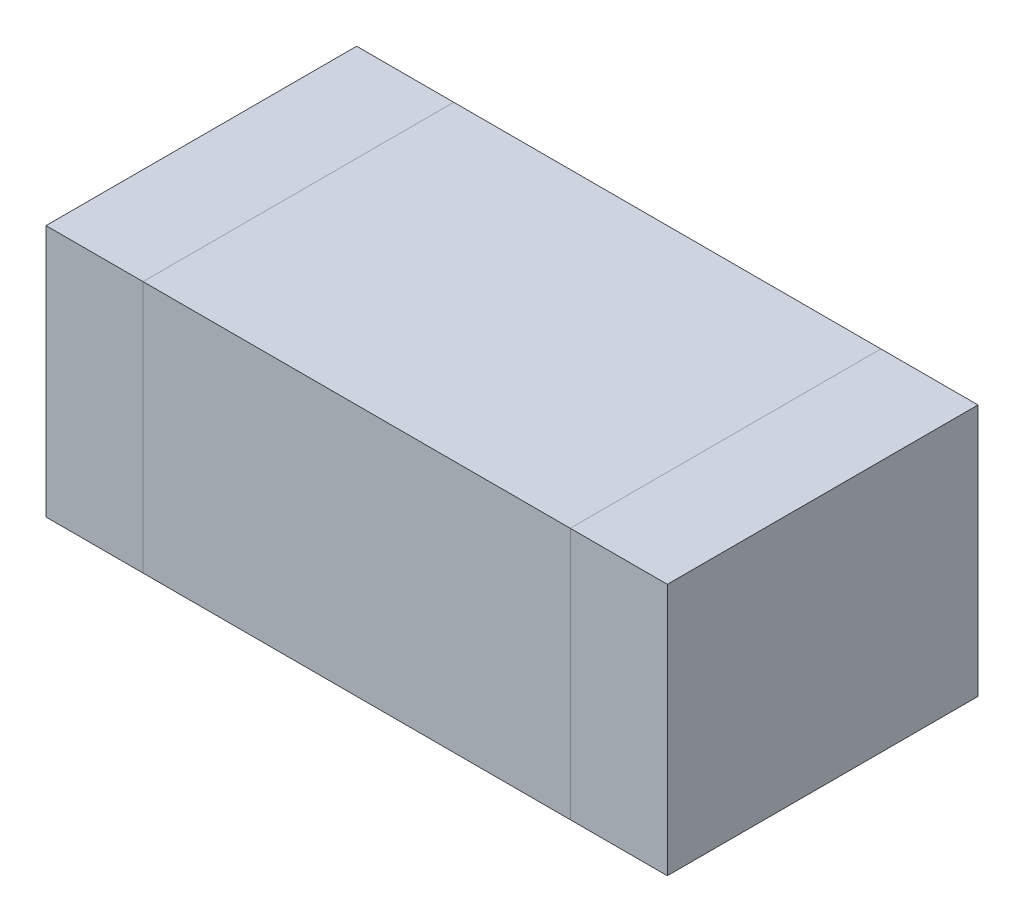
ISO-10303-21;
HEADER;
FILE_DESCRIPTION(('STEP AP214'),'2;1');
FILE_NAME('part.step','',(''),(''),'','','');
FILE_SCHEMA(('AUTOMOTIVE_DESIGN { 1 0 10303 214 1 1 1 1 }'));
ENDSEC;
DATA;
#1=APPLICATION_CONTEXT('core data for automotive mechanical design processes');
#2=APPLICATION_PROTOCOL_DEFINITION('international standard','automotive_design',2000,#1);
#3=PRODUCT_CONTEXT('',#1,'mechanical');
#4=PRODUCT('Part','Part','',(#3));
#5=PRODUCT_RELATED_PRODUCT_CATEGORY('part','',(#4));
#6=PRODUCT_DEFINITION_FORMATION('','',#4);
#7=PRODUCT_DEFINITION_CONTEXT('part definition',#1,'design');
#8=PRODUCT_DEFINITION('design','',#6,#7);
#9=PRODUCT_DEFINITION_SHAPE('','',#8);
#10=(LENGTH_UNIT() NAMED_UNIT(*) SI_UNIT(.MILLI.,.METRE.));
#11=(NAMED_UNIT(*) PLANE_ANGLE_UNIT() SI_UNIT($,.RADIAN.));
#12=(NAMED_UNIT(*) SI_UNIT($,.STERADIAN.) SOLID_ANGLE_UNIT());
#13=UNCERTAINTY_MEASURE_WITH_UNIT(LENGTH_MEASURE(1.E-05),#10,'distance_accuracy_value','');
#14=(GEOMETRIC_REPRESENTATION_CONTEXT(3) GLOBAL_UNCERTAINTY_ASSIGNED_CONTEXT((#13)) GLOBAL_UNIT_ASSIGNED_CONTEXT((#10,
#11,#12)) REPRESENTATION_CONTEXT('',''));
#15=CARTESIAN_POINT('',(0.,0.,0.));
#16=DIRECTION('',(0.,0.,1.));
#17=DIRECTION('',(1.,0.,0.));
#18=AXIS2_PLACEMENT_3D('',#15,#16,#17);
#19=CARTESIAN_POINT('',(2.7,-0.01,-1.6));
#20=DIRECTION('',(-1.,0.,0.));
#21=DIRECTION('',(0.,0.,1.));
#22=AXIS2_PLACEMENT_3D('',#19,#20,#21);
#23=PLANE('',#22);
#24=DIRECTION('',(0.,0.,-1.));
#25=VECTOR('',#24,1.);
#26=CARTESIAN_POINT('',(2.7,0.,0.));
#27=LINE('',#26,#25);
#28=CARTESIAN_POINT('',(2.7,0.,0.));
#29=VERTEX_POINT('',#28);
#30=CARTESIAN_POINT('',(2.7,0.,-1.6));
#31=VERTEX_POINT('',#30);
#32=EDGE_CURVE('E52',#29,#31,#27,.T.);
#33=ORIENTED_EDGE('',*,*,#32,.F.);
#34=DIRECTION('',(0.,1.,0.));
#35=VECTOR('',#34,1.);
#36=CARTESIAN_POINT('',(2.7,-0.01,0.));
#37=LINE('',#36,#35);
#38=CARTESIAN_POINT('',(2.7,1.3,0.));
#39=VERTEX_POINT('',#38);
#40=EDGE_CURVE('E94',#29,#39,#37,.T.);
#41=ORIENTED_EDGE('',*,*,#40,.T.);
#42=DIRECTION('',(0.,0.,-1.));
#43=VECTOR('',#42,1.);
#44=CARTESIAN_POINT('',(2.7,1.3,0.));
#45=LINE('',#44,#43);
#46=CARTESIAN_POINT('',(2.7,1.3,-1.6));
#47=VERTEX_POINT('',#46);
#48=EDGE_CURVE('E101',#39,#47,#45,.T.);
#49=ORIENTED_EDGE('',*,*,#48,.T.);
#50=DIRECTION('',(0.,-1.,0.));
#51=VECTOR('',#50,1.);
#52=CARTESIAN_POINT('',(2.7,1.3,-1.6));
#53=LINE('',#52,#51);
#54=EDGE_CURVE('E102',#47,#31,#53,.T.);
#55=ORIENTED_EDGE('',*,*,#54,.T.);
#56=EDGE_LOOP('',(#33,#41,#49,#55));
#57=FACE_BOUND('',#56,.T.);
#58=ADVANCED_FACE('F48',(#57),#23,.T.);
#59=CARTESIAN_POINT('',(0.,0.,0.));
#60=DIRECTION('',(0.,-1.,0.));
#61=DIRECTION('',(0.,0.,-1.));
#62=AXIS2_PLACEMENT_3D('',#59,#60,#61);
#63=PLANE('',#62);
#64=DIRECTION('',(1.,0.,0.));
#65=VECTOR('',#64,1.);
#66=CARTESIAN_POINT('',(0.,0.,0.));
#67=LINE('',#66,#65);
#68=CARTESIAN_POINT('',(3.2,0.,0.));
#69=VERTEX_POINT('',#68);
#70=EDGE_CURVE('E12',#29,#69,#67,.T.);
#71=ORIENTED_EDGE('',*,*,#70,.F.);
#72=ORIENTED_EDGE('',*,*,#32,.T.);
#73=DIRECTION('',(-1.,0.,0.));
#74=VECTOR('',#73,1.);
#75=CARTESIAN_POINT('',(0.,0.,-1.6));
#76=LINE('',#75,#74);
#77=CARTESIAN_POINT('',(3.2,0.,-1.6));
#78=VERTEX_POINT('',#77);
#79=EDGE_CURVE('E97',#78,#31,#76,.T.);
#80=ORIENTED_EDGE('',*,*,#79,.F.);
#81=DIRECTION('',(0.,0.,-1.));
#82=VECTOR('',#81,1.);
#83=CARTESIAN_POINT('',(3.2,0.,0.));
#84=LINE('',#83,#82);
#85=EDGE_CURVE('E58',#69,#78,#84,.T.);
#86=ORIENTED_EDGE('',*,*,#85,.F.);
#87=EDGE_LOOP('',(#71,#72,#80,#86));
#88=FACE_BOUND('',#87,.T.);
#89=ADVANCED_FACE('F120',(#88),#63,.T.);
#90=CARTESIAN_POINT('',(0.,1.3,0.));
#91=DIRECTION('',(0.,0.,-1.));
#92=DIRECTION('',(-1.,0.,0.));
#93=AXIS2_PLACEMENT_3D('',#90,#91,#92);
#94=PLANE('',#93);
#95=ORIENTED_EDGE('',*,*,#40,.F.);
#96=ORIENTED_EDGE('',*,*,#70,.T.);
#97=DIRECTION('',(0.,-1.,0.));
#98=VECTOR('',#97,1.);
#99=CARTESIAN_POINT('',(3.2,1.3,0.));
#100=LINE('',#99,#98);
#101=CARTESIAN_POINT('',(3.2,1.3,0.));
#102=VERTEX_POINT('',#101);
#103=EDGE_CURVE('E95',#102,#69,#100,.T.);
#104=ORIENTED_EDGE('',*,*,#103,.F.);
#105=DIRECTION('',(1.,0.,0.));
#106=VECTOR('',#105,1.);
#107=CARTESIAN_POINT('',(0.,1.3,0.));
#108=LINE('',#107,#106);
#109=EDGE_CURVE('E91',#39,#102,#108,.T.);
#110=ORIENTED_EDGE('',*,*,#109,.F.);
#111=EDGE_LOOP('',(#95,#96,#104,#110));
#112=FACE_BOUND('',#111,.T.);
#113=ADVANCED_FACE('F93',(#112),#94,.F.);
#114=CARTESIAN_POINT('',(0.,1.3,-1.6));
#115=DIRECTION('',(0.,0.,1.));
#116=DIRECTION('',(1.,0.,0.));
#117=AXIS2_PLACEMENT_3D('',#114,#115,#116);
#118=PLANE('',#117);
#119=ORIENTED_EDGE('',*,*,#54,.F.);
#120=DIRECTION('',(-1.,0.,0.));
#121=VECTOR('',#120,1.);
#122=CARTESIAN_POINT('',(0.,1.3,-1.6));
#123=LINE('',#122,#121);
#124=CARTESIAN_POINT('',(3.2,1.3,-1.6));
#125=VERTEX_POINT('',#124);
#126=EDGE_CURVE('E104',#125,#47,#123,.T.);
#127=ORIENTED_EDGE('',*,*,#126,.F.);
#128=DIRECTION('',(0.,-1.,0.));
#129=VECTOR('',#128,1.);
#130=CARTESIAN_POINT('',(3.2,1.3,-1.6));
#131=LINE('',#130,#129);
#132=EDGE_CURVE('E109',#125,#78,#131,.T.);
#133=ORIENTED_EDGE('',*,*,#132,.T.);
#134=ORIENTED_EDGE('',*,*,#79,.T.);
#135=EDGE_LOOP('',(#119,#127,#133,#134));
#136=FACE_BOUND('',#135,.T.);
#137=ADVANCED_FACE('F122',(#136),#118,.F.);
#138=CARTESIAN_POINT('',(3.2,1.3,0.));
#139=DIRECTION('',(-1.,0.,0.));
#140=DIRECTION('',(0.,0.,1.));
#141=AXIS2_PLACEMENT_3D('',#138,#139,#140);
#142=PLANE('',#141);
#143=ORIENTED_EDGE('',*,*,#85,.T.);
#144=ORIENTED_EDGE('',*,*,#132,.F.);
#145=DIRECTION('',(0.,0.,-1.));
#146=VECTOR('',#145,1.);
#147=CARTESIAN_POINT('',(3.2,1.3,0.));
#148=LINE('',#147,#146);
#149=EDGE_CURVE('E77',#102,#125,#148,.T.);
#150=ORIENTED_EDGE('',*,*,#149,.F.);
#151=ORIENTED_EDGE('',*,*,#103,.T.);
#152=EDGE_LOOP('',(#143,#144,#150,#151));
#153=FACE_BOUND('',#152,.T.);
#154=ADVANCED_FACE('F119',(#153),#142,.F.);
#155=CARTESIAN_POINT('',(0.,1.3,0.));
#156=DIRECTION('',(0.,-1.,0.));
#157=DIRECTION('',(0.,0.,-1.));
#158=AXIS2_PLACEMENT_3D('',#155,#156,#157);
#159=PLANE('',#158);
#160=ORIENTED_EDGE('',*,*,#48,.F.);
#161=ORIENTED_EDGE('',*,*,#109,.T.);
#162=ORIENTED_EDGE('',*,*,#149,.T.);
#163=ORIENTED_EDGE('',*,*,#126,.T.);
#164=EDGE_LOOP('',(#160,#161,#162,#163));
#165=FACE_BOUND('',#164,.T.);
#166=ADVANCED_FACE('F50',(#165),#159,.F.);
#167=CLOSED_SHELL('',(#58,#89,#113,#137,#154,#166));
#168=MANIFOLD_SOLID_BREP('B2',#167);
#169=CARTESIAN_POINT('',(0.5,-0.01,-1.6));
#170=DIRECTION('',(1.,0.,0.));
#171=DIRECTION('',(0.,0.,-1.));
#172=AXIS2_PLACEMENT_3D('',#169,#170,#171);
#173=PLANE('',#172);
#174=DIRECTION('',(0.,0.,1.));
#175=VECTOR('',#174,1.);
#176=CARTESIAN_POINT('',(0.5,0.,0.));
#177=LINE('',#176,#175);
#178=CARTESIAN_POINT('',(0.5,0.,-1.6));
#179=VERTEX_POINT('',#178);
#180=CARTESIAN_POINT('',(0.5,0.,0.));
#181=VERTEX_POINT('',#180);
#182=EDGE_CURVE('E239',#179,#181,#177,.T.);
#183=ORIENTED_EDGE('',*,*,#182,.T.);
#184=DIRECTION('',(0.,-1.,0.));
#185=VECTOR('',#184,1.);
#186=CARTESIAN_POINT('',(0.5,1.3,0.));
#187=LINE('',#186,#185);
#188=CARTESIAN_POINT('',(0.5,1.3,0.));
#189=VERTEX_POINT('',#188);
#190=EDGE_CURVE('E253',#189,#181,#187,.T.);
#191=ORIENTED_EDGE('',*,*,#190,.F.);
#192=DIRECTION('',(0.,0.,1.));
#193=VECTOR('',#192,1.);
#194=CARTESIAN_POINT('',(0.5,1.3,0.));
#195=LINE('',#194,#193);
#196=CARTESIAN_POINT('',(0.5,1.3,-1.6));
#197=VERTEX_POINT('',#196);
#198=EDGE_CURVE('E198',#197,#189,#195,.T.);
#199=ORIENTED_EDGE('',*,*,#198,.F.);
#200=DIRECTION('',(0.,1.,0.));
#201=VECTOR('',#200,1.);
#202=CARTESIAN_POINT('',(0.5,-0.01,-1.6));
#203=LINE('',#202,#201);
#204=EDGE_CURVE('E233',#179,#197,#203,.T.);
#205=ORIENTED_EDGE('',*,*,#204,.F.);
#206=EDGE_LOOP('',(#183,#191,#199,#205));
#207=FACE_BOUND('',#206,.T.);
#208=ADVANCED_FACE('F181',(#207),#173,.F.);
#209=CARTESIAN_POINT('',(2.7,-0.01,-1.6));
#210=DIRECTION('',(-1.,0.,0.));
#211=DIRECTION('',(0.,0.,1.));
#212=AXIS2_PLACEMENT_3D('',#209,#210,#211);
#213=PLANE('',#212);
#214=DIRECTION('',(0.,0.,-1.));
#215=VECTOR('',#214,1.);
#216=CARTESIAN_POINT('',(2.7,0.,0.));
#217=LINE('',#216,#215);
#218=CARTESIAN_POINT('',(2.7,0.,0.));
#219=VERTEX_POINT('',#218);
#220=CARTESIAN_POINT('',(2.7,0.,-1.6));
#221=VERTEX_POINT('',#220);
#222=EDGE_CURVE('E185',#219,#221,#217,.T.);
#223=ORIENTED_EDGE('',*,*,#222,.T.);
#224=DIRECTION('',(0.,-1.,0.));
#225=VECTOR('',#224,1.);
#226=CARTESIAN_POINT('',(2.7,1.3,-1.6));
#227=LINE('',#226,#225);
#228=CARTESIAN_POINT('',(2.7,1.3,-1.6));
#229=VERTEX_POINT('',#228);
#230=EDGE_CURVE('E227',#229,#221,#227,.T.);
#231=ORIENTED_EDGE('',*,*,#230,.F.);
#232=DIRECTION('',(0.,0.,-1.));
#233=VECTOR('',#232,1.);
#234=CARTESIAN_POINT('',(2.7,1.3,0.));
#235=LINE('',#234,#233);
#236=CARTESIAN_POINT('',(2.7,1.3,0.));
#237=VERTEX_POINT('',#236);
#238=EDGE_CURVE('E247',#237,#229,#235,.T.);
#239=ORIENTED_EDGE('',*,*,#238,.F.);
#240=DIRECTION('',(0.,1.,0.));
#241=VECTOR('',#240,1.);
#242=CARTESIAN_POINT('',(2.7,-0.01,0.));
#243=LINE('',#242,#241);
#244=EDGE_CURVE('E205',#219,#237,#243,.T.);
#245=ORIENTED_EDGE('',*,*,#244,.F.);
#246=EDGE_LOOP('',(#223,#231,#239,#245));
#247=FACE_BOUND('',#246,.T.);
#248=ADVANCED_FACE('F236',(#247),#213,.F.);
#249=CARTESIAN_POINT('',(0.,1.3,0.));
#250=DIRECTION('',(0.,0.,-1.));
#251=DIRECTION('',(-1.,0.,0.));
#252=AXIS2_PLACEMENT_3D('',#249,#250,#251);
#253=PLANE('',#252);
#254=DIRECTION('',(1.,0.,0.));
#255=VECTOR('',#254,1.);
#256=CARTESIAN_POINT('',(0.,1.3,0.));
#257=LINE('',#256,#255);
#258=EDGE_CURVE('E243',#189,#237,#257,.T.);
#259=ORIENTED_EDGE('',*,*,#258,.F.);
#260=ORIENTED_EDGE('',*,*,#190,.T.);
#261=DIRECTION('',(1.,0.,0.));
#262=VECTOR('',#261,1.);
#263=CARTESIAN_POINT('',(0.,0.,0.));
#264=LINE('',#263,#262);
#265=EDGE_CURVE('E46',#181,#219,#264,.T.);
#266=ORIENTED_EDGE('',*,*,#265,.T.);
#267=ORIENTED_EDGE('',*,*,#244,.T.);
#268=EDGE_LOOP('',(#259,#260,#266,#267));
#269=FACE_BOUND('',#268,.T.);
#270=ADVANCED_FACE('F255',(#269),#253,.F.);
#271=CARTESIAN_POINT('',(0.,1.3,-1.6));
#272=DIRECTION('',(0.,0.,1.));
#273=DIRECTION('',(1.,0.,0.));
#274=AXIS2_PLACEMENT_3D('',#271,#272,#273);
#275=PLANE('',#274);
#276=DIRECTION('',(-1.,0.,0.));
#277=VECTOR('',#276,1.);
#278=CARTESIAN_POINT('',(0.,0.,-1.6));
#279=LINE('',#278,#277);
#280=EDGE_CURVE('E190',#221,#179,#279,.T.);
#281=ORIENTED_EDGE('',*,*,#280,.T.);
#282=ORIENTED_EDGE('',*,*,#204,.T.);
#283=DIRECTION('',(-1.,0.,0.));
#284=VECTOR('',#283,1.);
#285=CARTESIAN_POINT('',(0.,1.3,-1.6));
#286=LINE('',#285,#284);
#287=EDGE_CURVE('E231',#229,#197,#286,.T.);
#288=ORIENTED_EDGE('',*,*,#287,.F.);
#289=ORIENTED_EDGE('',*,*,#230,.T.);
#290=EDGE_LOOP('',(#281,#282,#288,#289));
#291=FACE_BOUND('',#290,.T.);
#292=ADVANCED_FACE('F229',(#291),#275,.F.);
#293=CARTESIAN_POINT('',(0.,0.,0.));
#294=DIRECTION('',(0.,-1.,0.));
#295=DIRECTION('',(0.,0.,-1.));
#296=AXIS2_PLACEMENT_3D('',#293,#294,#295);
#297=PLANE('',#296);
#298=ORIENTED_EDGE('',*,*,#182,.F.);
#299=ORIENTED_EDGE('',*,*,#280,.F.);
#300=ORIENTED_EDGE('',*,*,#222,.F.);
#301=ORIENTED_EDGE('',*,*,#265,.F.);
#302=EDGE_LOOP('',(#298,#299,#300,#301));
#303=FACE_BOUND('',#302,.T.);
#304=ADVANCED_FACE('F241',(#303),#297,.T.);
#305=CARTESIAN_POINT('',(0.,1.3,0.));
#306=DIRECTION('',(0.,-1.,0.));
#307=DIRECTION('',(0.,0.,-1.));
#308=AXIS2_PLACEMENT_3D('',#305,#306,#307);
#309=PLANE('',#308);
#310=ORIENTED_EDGE('',*,*,#287,.T.);
#311=ORIENTED_EDGE('',*,*,#198,.T.);
#312=ORIENTED_EDGE('',*,*,#258,.T.);
#313=ORIENTED_EDGE('',*,*,#238,.T.);
#314=EDGE_LOOP('',(#310,#311,#312,#313));
#315=FACE_BOUND('',#314,.T.);
#316=ADVANCED_FACE('F183',(#315),#309,.F.);
#317=CLOSED_SHELL('',(#208,#248,#270,#292,#304,#316));
#318=MANIFOLD_SOLID_BREP('B6',#317);
#319=CARTESIAN_POINT('',(0.5,-0.01,-1.6));
#320=DIRECTION('',(1.,0.,0.));
#321=DIRECTION('',(0.,0.,-1.));
#322=AXIS2_PLACEMENT_3D('',#319,#320,#321);
#323=PLANE('',#322);
#324=DIRECTION('',(0.,0.,1.));
#325=VECTOR('',#324,1.);
#326=CARTESIAN_POINT('',(0.5,0.,0.));
#327=LINE('',#326,#325);
#328=CARTESIAN_POINT('',(0.5,0.,-1.6));
#329=VERTEX_POINT('',#328);
#330=CARTESIAN_POINT('',(0.5,0.,0.));
#331=VERTEX_POINT('',#330);
#332=EDGE_CURVE('E378',#329,#331,#327,.T.);
#333=ORIENTED_EDGE('',*,*,#332,.F.);
#334=DIRECTION('',(0.,1.,0.));
#335=VECTOR('',#334,1.);
#336=CARTESIAN_POINT('',(0.5,-0.01,-1.6));
#337=LINE('',#336,#335);
#338=CARTESIAN_POINT('',(0.5,1.3,-1.6));
#339=VERTEX_POINT('',#338);
#340=EDGE_CURVE('E321',#329,#339,#337,.T.);
#341=ORIENTED_EDGE('',*,*,#340,.T.);
#342=DIRECTION('',(0.,0.,1.));
#343=VECTOR('',#342,1.);
#344=CARTESIAN_POINT('',(0.5,1.3,0.));
#345=LINE('',#344,#343);
#346=CARTESIAN_POINT('',(0.5,1.3,0.));
#347=VERTEX_POINT('',#346);
#348=EDGE_CURVE('E179',#339,#347,#345,.T.);
#349=ORIENTED_EDGE('',*,*,#348,.T.);
#350=DIRECTION('',(0.,-1.,0.));
#351=VECTOR('',#350,1.);
#352=CARTESIAN_POINT('',(0.5,1.3,0.));
#353=LINE('',#352,#351);
#354=EDGE_CURVE('E366',#347,#331,#353,.T.);
#355=ORIENTED_EDGE('',*,*,#354,.T.);
#356=EDGE_LOOP('',(#333,#341,#349,#355));
#357=FACE_BOUND('',#356,.T.);
#358=ADVANCED_FACE('F318',(#357),#323,.T.);
#359=CARTESIAN_POINT('',(0.,0.,0.));
#360=DIRECTION('',(0.,-1.,0.));
#361=DIRECTION('',(0.,0.,-1.));
#362=AXIS2_PLACEMENT_3D('',#359,#360,#361);
#363=PLANE('',#362);
#364=DIRECTION('',(-1.,0.,0.));
#365=VECTOR('',#364,1.);
#366=CARTESIAN_POINT('',(0.,0.,-1.6));
#367=LINE('',#366,#365);
#368=CARTESIAN_POINT('',(0.,0.,-1.6));
#369=VERTEX_POINT('',#368);
#370=EDGE_CURVE('E373',#329,#369,#367,.T.);
#371=ORIENTED_EDGE('',*,*,#370,.F.);
#372=ORIENTED_EDGE('',*,*,#332,.T.);
#373=DIRECTION('',(1.,0.,0.));
#374=VECTOR('',#373,1.);
#375=CARTESIAN_POINT('',(0.,0.,0.));
#376=LINE('',#375,#374);
#377=CARTESIAN_POINT('',(0.,0.,0.));
#378=VERTEX_POINT('',#377);
#379=EDGE_CURVE('E389',#378,#331,#376,.T.);
#380=ORIENTED_EDGE('',*,*,#379,.F.);
#381=DIRECTION('',(0.,0.,1.));
#382=VECTOR('',#381,1.);
#383=CARTESIAN_POINT('',(0.,0.,0.));
#384=LINE('',#383,#382);
#385=EDGE_CURVE('E377',#369,#378,#384,.T.);
#386=ORIENTED_EDGE('',*,*,#385,.F.);
#387=EDGE_LOOP('',(#371,#372,#380,#386));
#388=FACE_BOUND('',#387,.T.);
#389=ADVANCED_FACE('F388',(#388),#363,.T.);
#390=CARTESIAN_POINT('',(0.,1.3,-1.6));
#391=DIRECTION('',(0.,0.,1.));
#392=DIRECTION('',(1.,0.,0.));
#393=AXIS2_PLACEMENT_3D('',#390,#391,#392);
#394=PLANE('',#393);
#395=ORIENTED_EDGE('',*,*,#340,.F.);
#396=ORIENTED_EDGE('',*,*,#370,.T.);
#397=DIRECTION('',(0.,-1.,0.));
#398=VECTOR('',#397,1.);
#399=CARTESIAN_POINT('',(0.,1.3,-1.6));
#400=LINE('',#399,#398);
#401=CARTESIAN_POINT('',(0.,1.3,-1.6));
#402=VERTEX_POINT('',#401);
#403=EDGE_CURVE('E379',#402,#369,#400,.T.);
#404=ORIENTED_EDGE('',*,*,#403,.F.);
#405=DIRECTION('',(-1.,0.,0.));
#406=VECTOR('',#405,1.);
#407=CARTESIAN_POINT('',(0.,1.3,-1.6));
#408=LINE('',#407,#406);
#409=EDGE_CURVE('E341',#339,#402,#408,.T.);
#410=ORIENTED_EDGE('',*,*,#409,.F.);
#411=EDGE_LOOP('',(#395,#396,#404,#410));
#412=FACE_BOUND('',#411,.T.);
#413=ADVANCED_FACE('F386',(#412),#394,.F.);
#414=CARTESIAN_POINT('',(0.,1.3,0.));
#415=DIRECTION('',(0.,0.,-1.));
#416=DIRECTION('',(-1.,0.,0.));
#417=AXIS2_PLACEMENT_3D('',#414,#415,#416);
#418=PLANE('',#417);
#419=ORIENTED_EDGE('',*,*,#354,.F.);
#420=DIRECTION('',(1.,0.,0.));
#421=VECTOR('',#420,1.);
#422=CARTESIAN_POINT('',(0.,1.3,0.));
#423=LINE('',#422,#421);
#424=CARTESIAN_POINT('',(0.,1.3,0.));
#425=VERTEX_POINT('',#424);
#426=EDGE_CURVE('E333',#425,#347,#423,.T.);
#427=ORIENTED_EDGE('',*,*,#426,.F.);
#428=DIRECTION('',(0.,-1.,0.));
#429=VECTOR('',#428,1.);
#430=CARTESIAN_POINT('',(0.,1.3,0.));
#431=LINE('',#430,#429);
#432=EDGE_CURVE('E363',#425,#378,#431,.T.);
#433=ORIENTED_EDGE('',*,*,#432,.T.);
#434=ORIENTED_EDGE('',*,*,#379,.T.);
#435=EDGE_LOOP('',(#419,#427,#433,#434));
#436=FACE_BOUND('',#435,.T.);
#437=ADVANCED_FACE('F360',(#436),#418,.F.);
#438=CARTESIAN_POINT('',(0.,1.3,0.));
#439=DIRECTION('',(1.,0.,0.));
#440=DIRECTION('',(0.,0.,-1.));
#441=AXIS2_PLACEMENT_3D('',#438,#439,#440);
#442=PLANE('',#441);
#443=ORIENTED_EDGE('',*,*,#385,.T.);
#444=ORIENTED_EDGE('',*,*,#432,.F.);
#445=DIRECTION('',(0.,0.,1.));
#446=VECTOR('',#445,1.);
#447=CARTESIAN_POINT('',(0.,1.3,0.));
#448=LINE('',#447,#446);
#449=EDGE_CURVE('E367',#402,#425,#448,.T.);
#450=ORIENTED_EDGE('',*,*,#449,.F.);
#451=ORIENTED_EDGE('',*,*,#403,.T.);
#452=EDGE_LOOP('',(#443,#444,#450,#451));
#453=FACE_BOUND('',#452,.T.);
#454=ADVANCED_FACE('F375',(#453),#442,.F.);
#455=CARTESIAN_POINT('',(0.,1.3,0.));
#456=DIRECTION('',(0.,-1.,0.));
#457=DIRECTION('',(0.,0.,-1.));
#458=AXIS2_PLACEMENT_3D('',#455,#456,#457);
#459=PLANE('',#458);
#460=ORIENTED_EDGE('',*,*,#348,.F.);
#461=ORIENTED_EDGE('',*,*,#409,.T.);
#462=ORIENTED_EDGE('',*,*,#449,.T.);
#463=ORIENTED_EDGE('',*,*,#426,.T.);
#464=EDGE_LOOP('',(#460,#461,#462,#463));
#465=FACE_BOUND('',#464,.T.);
#466=ADVANCED_FACE('F370',(#465),#459,.F.);
#467=CLOSED_SHELL('',(#358,#389,#413,#437,#454,#466));
#468=MANIFOLD_SOLID_BREP('B40',#467);
#469=ADVANCED_BREP_SHAPE_REPRESENTATION('',(#18,#168,#318,#468),#14);
#470=SHAPE_DEFINITION_REPRESENTATION(#9,#469);
ENDSEC;
END-ISO-10303-21;
